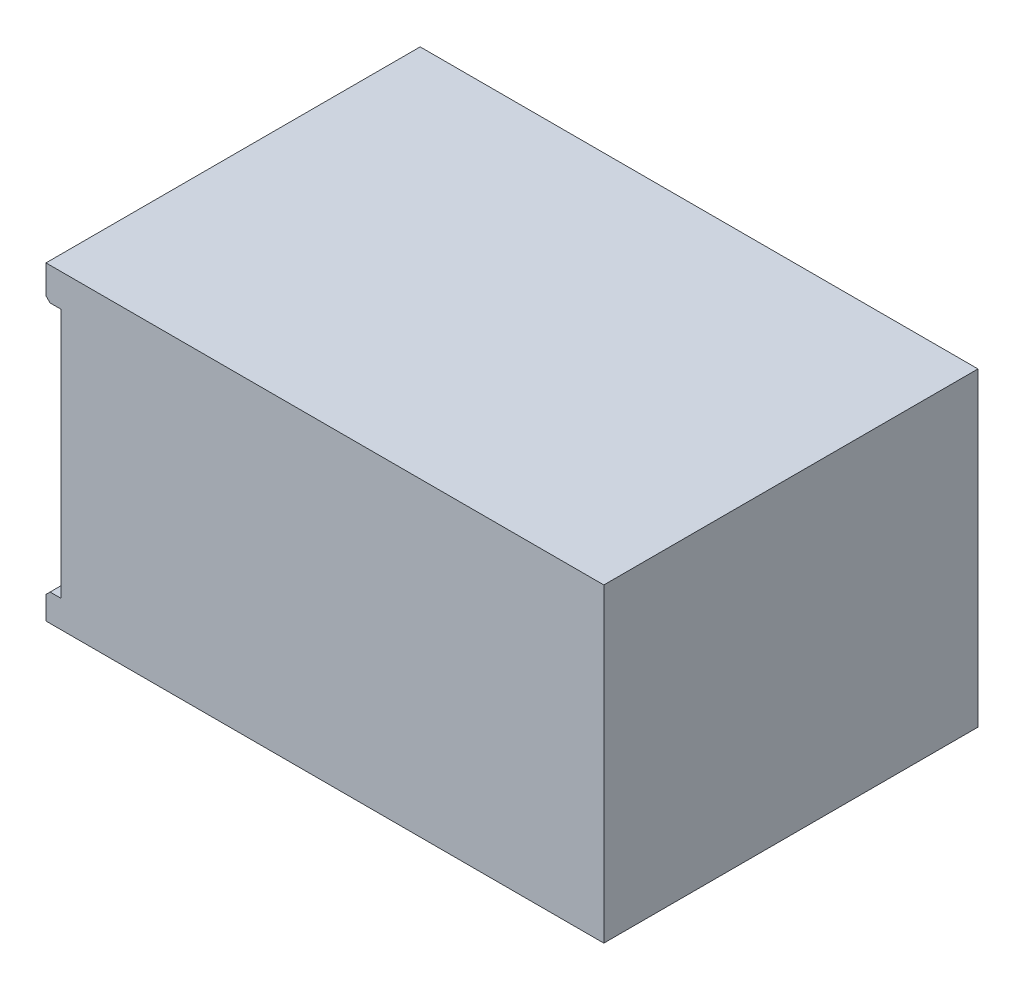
from build123d import *

# Parameters (mm, degrees)
EXTRUDE1_DEPTH                  = 17.4625
F_6_32_TAPPED_HOLE1_D           = 2.7051
F_6_32_TAPPED_HOLE1_DEPTH       = 9.99744
F_6_32_TAPPED_HOLE1_CBORE_D     = 3.5052
F_6_32_TAPPED_HOLE1_CBORE_DEPTH = 7.62
F_6_32_TAPPED_HOLE1_TIP         = 0.81269403
CHAMFER1_SIZE                   = 0.381


with BuildPart() as part:
    # Sketch1 → Extrude1 (new, symmetric)
    with BuildSketch(Plane.XY):
        Polygon((50.673, 0), (50.673, -28.956), (-1.397, -28.956), (-1.397, -26.416), (0, -26.416), (0, -3.048), (-1.397, -3.048), (-1.397, 0), align=None)
    extrude(amount=EXTRUDE1_DEPTH, both=True)

    # 6-32 Tapped Hole1
    with Locations(Plane(origin=(0, -22.86, -13.97), x_dir=(0, 0, -1), z_dir=(-1, 0, 0))):
        with Locations((0, 0), (-27.94, -16.764)):
            CounterBoreHole(F_6_32_TAPPED_HOLE1_D / 2, F_6_32_TAPPED_HOLE1_CBORE_D / 2, F_6_32_TAPPED_HOLE1_CBORE_DEPTH, depth=F_6_32_TAPPED_HOLE1_DEPTH)
            with Locations((0, 0, -(F_6_32_TAPPED_HOLE1_DEPTH + F_6_32_TAPPED_HOLE1_TIP / 2))):  # 118° drill point
                Cone(0, F_6_32_TAPPED_HOLE1_D / 2, F_6_32_TAPPED_HOLE1_TIP, mode=Mode.SUBTRACT)

    # Chamfer1
    chamfer1_edges = [part.edges().sort_by_distance(p)[0] for p in [
        (-1.397, -26.416, 0),
        (-1.397, -3.048, 0),
    ]]
    chamfer(chamfer1_edges, length=CHAMFER1_SIZE)


solid = part.part
